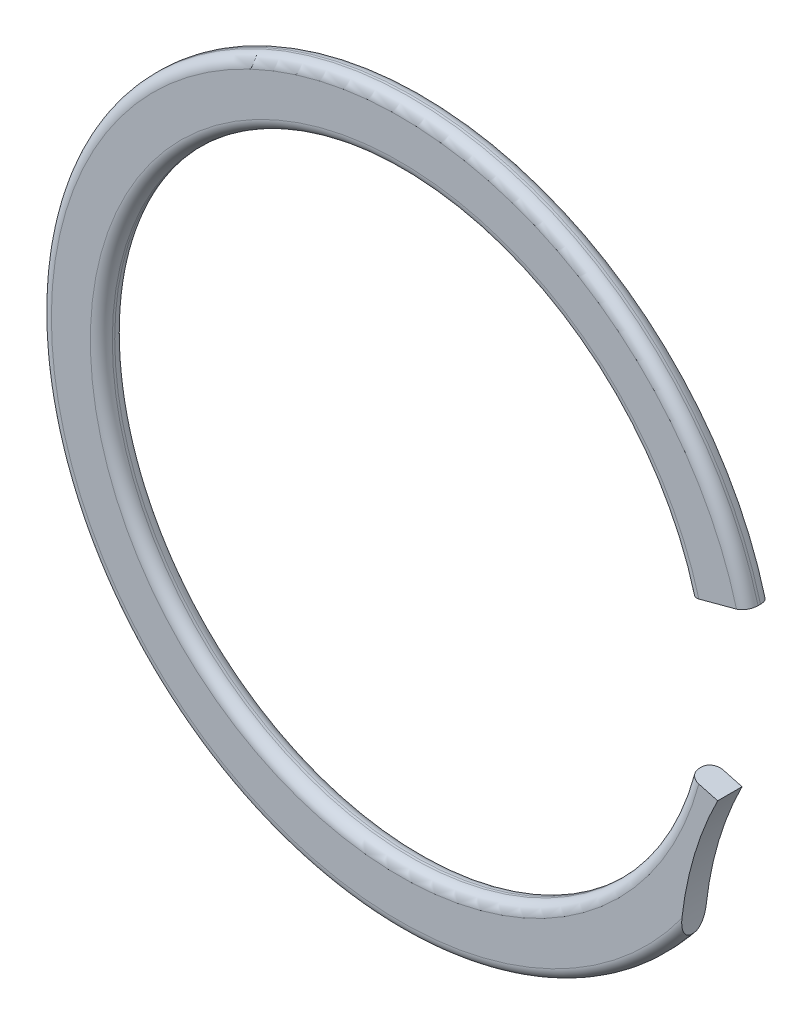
from build123d import *

# Parameters (mm, degrees)
EXTRUDE1_DEPTH = 0.2286
FILLET1_R      = 0.20574


with BuildPart() as part:
    # Sketch2 → Extrude1 (new, symmetric)
    with BuildSketch(Plane.XY):
        with BuildLine():
            Line((5.409860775, -1.449567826), (5.961887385, -1.59748291))
            ThreePointArc((5.961887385, -1.59748291), (5.473784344, -2.873056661), (5.258707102, -4.221787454))
            ThreePointArc((5.258707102, -4.221787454), (-6.599278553, 1.388168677), (6.513913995, 1.745397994))
            Line((6.513913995, 1.745397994), (5.409860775, 1.449567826))
            ThreePointArc((5.409860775, 1.449567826), (-5.6007, 0), (5.409860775, -1.449567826))
        make_face()
    extrude(amount=EXTRUDE1_DEPTH, both=True)

    # Fillet1
    fillet1_edges = [part.edges().sort_by_distance(p)[0] for p in [
        (-6.599278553, 1.388168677, 0.2286),
        (-5.6007, 0, 0.2286),
        (-6.599278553, 1.388168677, -0.2286),
        (-5.6007, 0, -0.2286),
    ]]
    fillet(fillet1_edges, radius=FILLET1_R)


solid = part.part
